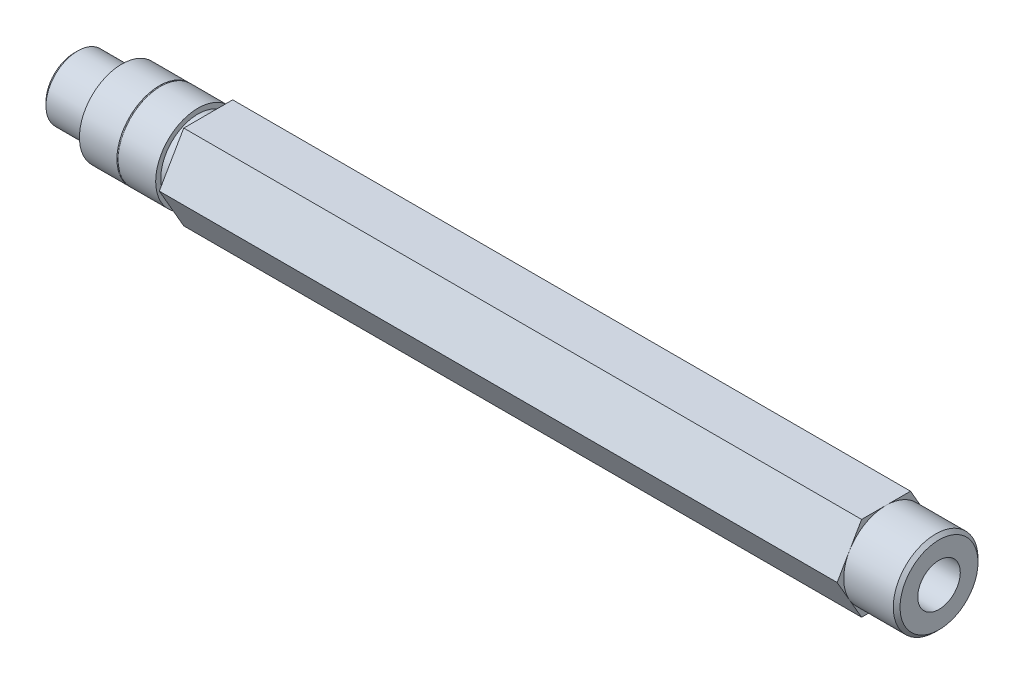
ISO-10303-21;
HEADER;
FILE_DESCRIPTION(('STEP AP214'),'2;1');
FILE_NAME('part.step','',(''),(''),'','','');
FILE_SCHEMA(('AUTOMOTIVE_DESIGN { 1 0 10303 214 1 1 1 1 }'));
ENDSEC;
DATA;
#1=APPLICATION_CONTEXT('core data for automotive mechanical design processes');
#2=APPLICATION_PROTOCOL_DEFINITION('international standard','automotive_design',2000,#1);
#3=PRODUCT_CONTEXT('',#1,'mechanical');
#4=PRODUCT('Part','Part','',(#3));
#5=PRODUCT_RELATED_PRODUCT_CATEGORY('part','',(#4));
#6=PRODUCT_DEFINITION_FORMATION('','',#4);
#7=PRODUCT_DEFINITION_CONTEXT('part definition',#1,'design');
#8=PRODUCT_DEFINITION('design','',#6,#7);
#9=PRODUCT_DEFINITION_SHAPE('','',#8);
#10=(LENGTH_UNIT() NAMED_UNIT(*) SI_UNIT(.MILLI.,.METRE.));
#11=(NAMED_UNIT(*) PLANE_ANGLE_UNIT() SI_UNIT($,.RADIAN.));
#12=(NAMED_UNIT(*) SI_UNIT($,.STERADIAN.) SOLID_ANGLE_UNIT());
#13=UNCERTAINTY_MEASURE_WITH_UNIT(LENGTH_MEASURE(1.E-05),#10,'distance_accuracy_value','');
#14=(GEOMETRIC_REPRESENTATION_CONTEXT(3) GLOBAL_UNCERTAINTY_ASSIGNED_CONTEXT((#13)) GLOBAL_UNIT_ASSIGNED_CONTEXT((#10,
#11,#12)) REPRESENTATION_CONTEXT('',''));
#15=CARTESIAN_POINT('',(0.,0.,0.));
#16=DIRECTION('',(0.,0.,1.));
#17=DIRECTION('',(1.,0.,0.));
#18=AXIS2_PLACEMENT_3D('',#15,#16,#17);
#19=CARTESIAN_POINT('',(12.827,0.,0.));
#20=DIRECTION('',(-1.,0.,0.));
#21=DIRECTION('',(0.,0.,1.));
#22=AXIS2_PLACEMENT_3D('',#19,#20,#21);
#23=TOROIDAL_SURFACE('',#22,6.35,0.0889);
#24=CARTESIAN_POINT('',(12.9159,0.,0.));
#25=DIRECTION('',(-1.,0.,0.));
#26=DIRECTION('',(0.,0.,1.));
#27=AXIS2_PLACEMENT_3D('',#24,#25,#26);
#28=CIRCLE('',#27,6.35);
#29=CARTESIAN_POINT('',(12.9159,0.,6.35));
#30=VERTEX_POINT('',#29);
#31=EDGE_CURVE('E21',#30,#30,#28,.T.);
#32=ORIENTED_EDGE('',*,*,#31,.T.);
#33=EDGE_LOOP('',(#32));
#34=FACE_BOUND('',#33,.T.);
#35=CARTESIAN_POINT('',(12.7381,0.,0.));
#36=DIRECTION('',(1.,0.,0.));
#37=DIRECTION('',(0.,0.,-1.));
#38=AXIS2_PLACEMENT_3D('',#35,#36,#37);
#39=CIRCLE('',#38,6.35);
#40=CARTESIAN_POINT('',(12.7381,0.,-6.35));
#41=VERTEX_POINT('',#40);
#42=EDGE_CURVE('E11',#41,#41,#39,.T.);
#43=ORIENTED_EDGE('',*,*,#42,.T.);
#44=EDGE_LOOP('',(#43));
#45=FACE_BOUND('',#44,.T.);
#46=ADVANCED_FACE('F17',(#34,#45),#23,.F.);
#47=CARTESIAN_POINT('',(18.542,0.,0.));
#48=DIRECTION('',(-1.,0.,0.));
#49=DIRECTION('',(0.,0.,1.));
#50=AXIS2_PLACEMENT_3D('',#47,#48,#49);
#51=CYLINDRICAL_SURFACE('',#50,6.35);
#52=ORIENTED_EDGE('',*,*,#42,.F.);
#53=EDGE_LOOP('',(#52));
#54=FACE_BOUND('',#53,.T.);
#55=CARTESIAN_POINT('',(7.112,0.,0.));
#56=DIRECTION('',(1.,0.,0.));
#57=DIRECTION('',(0.,0.,-1.));
#58=AXIS2_PLACEMENT_3D('',#55,#56,#57);
#59=CIRCLE('',#58,6.35);
#60=CARTESIAN_POINT('',(7.112,0.,-6.35));
#61=VERTEX_POINT('',#60);
#62=EDGE_CURVE('E181',#61,#61,#59,.T.);
#63=ORIENTED_EDGE('',*,*,#62,.T.);
#64=EDGE_LOOP('',(#63));
#65=FACE_BOUND('',#64,.T.);
#66=ADVANCED_FACE('F19',(#54,#65),#51,.T.);
#67=CARTESIAN_POINT('',(7.112,0.,0.));
#68=DIRECTION('',(-1.,0.,0.));
#69=DIRECTION('',(0.,0.,1.));
#70=AXIS2_PLACEMENT_3D('',#67,#68,#69);
#71=CYLINDRICAL_SURFACE('',#70,4.7625);
#72=CARTESIAN_POINT('',(7.112,0.,0.));
#73=DIRECTION('',(1.,0.,0.));
#74=DIRECTION('',(0.,0.,-1.));
#75=AXIS2_PLACEMENT_3D('',#72,#73,#74);
#76=CIRCLE('',#75,4.7625);
#77=CARTESIAN_POINT('',(7.112,0.,-4.7625));
#78=VERTEX_POINT('',#77);
#79=EDGE_CURVE('E177',#78,#78,#76,.T.);
#80=ORIENTED_EDGE('',*,*,#79,.F.);
#81=EDGE_LOOP('',(#80));
#82=FACE_BOUND('',#81,.T.);
#83=CARTESIAN_POINT('',(0.50800000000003,0.,0.));
#84=DIRECTION('',(1.,0.,0.));
#85=DIRECTION('',(0.,0.,-1.));
#86=AXIS2_PLACEMENT_3D('',#83,#84,#85);
#87=CIRCLE('',#86,4.7625);
#88=CARTESIAN_POINT('',(0.50800000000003,0.,-4.7625));
#89=VERTEX_POINT('',#88);
#90=EDGE_CURVE('E27',#89,#89,#87,.T.);
#91=ORIENTED_EDGE('',*,*,#90,.T.);
#92=EDGE_LOOP('',(#91));
#93=FACE_BOUND('',#92,.T.);
#94=ADVANCED_FACE('F352',(#82,#93),#71,.T.);
#95=CARTESIAN_POINT('',(0.50800000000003,0.,0.));
#96=DIRECTION('',(1.,0.,0.));
#97=DIRECTION('',(0.,0.,-1.));
#98=AXIS2_PLACEMENT_3D('',#95,#96,#97);
#99=CONICAL_SURFACE('',#98,4.7625,0.785398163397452);
#100=CARTESIAN_POINT('',(0.,0.,0.));
#101=DIRECTION('',(-1.,0.,0.));
#102=DIRECTION('',(0.,0.,-1.));
#103=AXIS2_PLACEMENT_3D('',#100,#101,#102);
#104=CIRCLE('',#103,4.2545);
#105=CARTESIAN_POINT('',(0.,0.,-4.2545));
#106=VERTEX_POINT('',#105);
#107=EDGE_CURVE('E187',#106,#106,#104,.T.);
#108=ORIENTED_EDGE('',*,*,#107,.F.);
#109=EDGE_LOOP('',(#108));
#110=FACE_BOUND('',#109,.T.);
#111=ORIENTED_EDGE('',*,*,#90,.F.);
#112=EDGE_LOOP('',(#111));
#113=FACE_BOUND('',#112,.T.);
#114=ADVANCED_FACE('F452',(#110,#113),#99,.T.);
#115=CARTESIAN_POINT('',(0.,0.,0.));
#116=DIRECTION('',(-1.,0.,0.));
#117=DIRECTION('',(0.,0.,1.));
#118=AXIS2_PLACEMENT_3D('',#115,#116,#117);
#119=CYLINDRICAL_SURFACE('',#118,3.1877);
#120=CARTESIAN_POINT('',(12.7,0.,0.));
#121=DIRECTION('',(-1.,0.,0.));
#122=DIRECTION('',(0.,0.,1.));
#123=AXIS2_PLACEMENT_3D('',#120,#121,#122);
#124=CIRCLE('',#123,3.1877);
#125=CARTESIAN_POINT('',(12.7,0.,3.1877));
#126=VERTEX_POINT('',#125);
#127=EDGE_CURVE('E191',#126,#126,#124,.T.);
#128=ORIENTED_EDGE('',*,*,#127,.F.);
#129=EDGE_LOOP('',(#128));
#130=FACE_BOUND('',#129,.T.);
#131=CARTESIAN_POINT('',(0.,0.,0.));
#132=DIRECTION('',(-1.,0.,0.));
#133=DIRECTION('',(0.,0.,1.));
#134=AXIS2_PLACEMENT_3D('',#131,#132,#133);
#135=CIRCLE('',#134,3.1877);
#136=CARTESIAN_POINT('',(0.,0.,3.1877));
#137=VERTEX_POINT('',#136);
#138=EDGE_CURVE('E199',#137,#137,#135,.T.);
#139=ORIENTED_EDGE('',*,*,#138,.T.);
#140=EDGE_LOOP('',(#139));
#141=FACE_BOUND('',#140,.T.);
#142=ADVANCED_FACE('F449',(#130,#141),#119,.F.);
#143=CARTESIAN_POINT('',(12.7,0.,0.));
#144=DIRECTION('',(-1.,0.,0.));
#145=DIRECTION('',(0.,0.,1.));
#146=AXIS2_PLACEMENT_3D('',#143,#144,#145);
#147=CONICAL_SURFACE('',#146,3.1877,1.02974425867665);
#148=CARTESIAN_POINT('',(14.6153633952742,0.,0.));
#149=VERTEX_POINT('',#148);
#150=VERTEX_LOOP('',#149);
#151=FACE_BOUND('',#150,.T.);
#152=ORIENTED_EDGE('',*,*,#127,.T.);
#153=EDGE_LOOP('',(#152));
#154=FACE_BOUND('',#153,.T.);
#155=ADVANCED_FACE('F447',(#151,#154),#147,.F.);
#156=CARTESIAN_POINT('',(0.,0.,0.));
#157=DIRECTION('',(-1.,0.,0.));
#158=DIRECTION('',(0.,0.,1.));
#159=AXIS2_PLACEMENT_3D('',#156,#157,#158);
#160=CYLINDRICAL_SURFACE('',#159,3.1877);
#161=CARTESIAN_POINT('',(116.9035,0.,0.));
#162=DIRECTION('',(1.,0.,0.));
#163=DIRECTION('',(0.,0.,-1.));
#164=AXIS2_PLACEMENT_3D('',#161,#162,#163);
#165=CIRCLE('',#164,3.1877);
#166=CARTESIAN_POINT('',(116.9035,0.,-3.1877));
#167=VERTEX_POINT('',#166);
#168=EDGE_CURVE('E229',#167,#167,#165,.T.);
#169=ORIENTED_EDGE('',*,*,#168,.F.);
#170=EDGE_LOOP('',(#169));
#171=FACE_BOUND('',#170,.T.);
#172=CARTESIAN_POINT('',(129.6035,0.,0.));
#173=DIRECTION('',(1.,0.,0.));
#174=DIRECTION('',(0.,0.,-1.));
#175=AXIS2_PLACEMENT_3D('',#172,#173,#174);
#176=CIRCLE('',#175,3.1877);
#177=CARTESIAN_POINT('',(129.6035,0.,-3.1877));
#178=VERTEX_POINT('',#177);
#179=EDGE_CURVE('E223',#178,#178,#176,.T.);
#180=ORIENTED_EDGE('',*,*,#179,.T.);
#181=EDGE_LOOP('',(#180));
#182=FACE_BOUND('',#181,.T.);
#183=ADVANCED_FACE('F471',(#171,#182),#160,.F.);
#184=CARTESIAN_POINT('',(116.9035,0.,0.));
#185=DIRECTION('',(1.,0.,0.));
#186=DIRECTION('',(0.,0.,-1.));
#187=AXIS2_PLACEMENT_3D('',#184,#185,#186);
#188=CONICAL_SURFACE('',#187,3.1877,1.02974425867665);
#189=CARTESIAN_POINT('',(114.988136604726,0.,0.));
#190=VERTEX_POINT('',#189);
#191=VERTEX_LOOP('',#190);
#192=FACE_BOUND('',#191,.T.);
#193=ORIENTED_EDGE('',*,*,#168,.T.);
#194=EDGE_LOOP('',(#193));
#195=FACE_BOUND('',#194,.T.);
#196=ADVANCED_FACE('F475',(#192,#195),#188,.F.);
#197=CARTESIAN_POINT('',(129.6035,0.,0.));
#198=DIRECTION('',(-1.,0.,0.));
#199=DIRECTION('',(0.,0.,1.));
#200=AXIS2_PLACEMENT_3D('',#197,#198,#199);
#201=CONICAL_SURFACE('',#200,5.842,0.785398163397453);
#202=CARTESIAN_POINT('',(129.6035,0.,0.));
#203=DIRECTION('',(1.,0.,0.));
#204=DIRECTION('',(0.,0.,-1.));
#205=AXIS2_PLACEMENT_3D('',#202,#203,#204);
#206=CIRCLE('',#205,5.842);
#207=CARTESIAN_POINT('',(129.6035,0.,-5.842));
#208=VERTEX_POINT('',#207);
#209=EDGE_CURVE('E209',#208,#208,#206,.T.);
#210=ORIENTED_EDGE('',*,*,#209,.F.);
#211=EDGE_LOOP('',(#210));
#212=FACE_BOUND('',#211,.T.);
#213=CARTESIAN_POINT('',(129.0955,0.,0.));
#214=DIRECTION('',(-1.,0.,0.));
#215=DIRECTION('',(0.,0.,-1.));
#216=AXIS2_PLACEMENT_3D('',#213,#214,#215);
#217=CIRCLE('',#216,6.35);
#218=CARTESIAN_POINT('',(129.0955,0.,-6.35));
#219=VERTEX_POINT('',#218);
#220=EDGE_CURVE('E232',#219,#219,#217,.T.);
#221=ORIENTED_EDGE('',*,*,#220,.F.);
#222=EDGE_LOOP('',(#221));
#223=FACE_BOUND('',#222,.T.);
#224=ADVANCED_FACE('F479',(#212,#223),#201,.T.);
#225=CARTESIAN_POINT('',(18.542,0.,0.));
#226=DIRECTION('',(-1.,0.,0.));
#227=DIRECTION('',(0.,0.,1.));
#228=AXIS2_PLACEMENT_3D('',#225,#226,#227);
#229=CYLINDRICAL_SURFACE('',#228,6.35);
#230=ORIENTED_EDGE('',*,*,#220,.T.);
#231=EDGE_LOOP('',(#230));
#232=FACE_BOUND('',#231,.T.);
#233=CARTESIAN_POINT('',(121.666,0.,0.));
#234=DIRECTION('',(1.,0.,0.));
#235=DIRECTION('',(0.,0.,-1.));
#236=AXIS2_PLACEMENT_3D('',#233,#234,#235);
#237=CIRCLE('',#236,6.35);
#238=CARTESIAN_POINT('',(121.666,3.175,5.49926131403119));
#239=VERTEX_POINT('',#238);
#240=CARTESIAN_POINT('',(121.666,-3.175,5.49926131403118));
#241=VERTEX_POINT('',#240);
#242=EDGE_CURVE('E280',#239,#241,#237,.T.);
#243=ORIENTED_EDGE('',*,*,#242,.T.);
#244=CARTESIAN_POINT('',(121.666,0.,0.));
#245=DIRECTION('',(1.,0.,0.));
#246=DIRECTION('',(0.,0.,-1.));
#247=AXIS2_PLACEMENT_3D('',#244,#245,#246);
#248=CIRCLE('',#247,6.35);
#249=CARTESIAN_POINT('',(121.666,-6.35,0.));
#250=VERTEX_POINT('',#249);
#251=EDGE_CURVE('E284',#241,#250,#248,.T.);
#252=ORIENTED_EDGE('',*,*,#251,.T.);
#253=CARTESIAN_POINT('',(121.666,0.,0.));
#254=DIRECTION('',(1.,0.,0.));
#255=DIRECTION('',(0.,0.,-1.));
#256=AXIS2_PLACEMENT_3D('',#253,#254,#255);
#257=CIRCLE('',#256,6.35);
#258=CARTESIAN_POINT('',(121.666,-3.175,-5.49926131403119));
#259=VERTEX_POINT('',#258);
#260=EDGE_CURVE('E311',#250,#259,#257,.T.);
#261=ORIENTED_EDGE('',*,*,#260,.T.);
#262=CARTESIAN_POINT('',(121.666,0.,0.));
#263=DIRECTION('',(1.,0.,0.));
#264=DIRECTION('',(0.,0.,-1.));
#265=AXIS2_PLACEMENT_3D('',#262,#263,#264);
#266=CIRCLE('',#265,6.35);
#267=CARTESIAN_POINT('',(121.666,3.175,-5.49926131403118));
#268=VERTEX_POINT('',#267);
#269=EDGE_CURVE('E206',#259,#268,#266,.T.);
#270=ORIENTED_EDGE('',*,*,#269,.T.);
#271=CARTESIAN_POINT('',(121.666,0.,0.));
#272=DIRECTION('',(1.,0.,0.));
#273=DIRECTION('',(0.,0.,-1.));
#274=AXIS2_PLACEMENT_3D('',#271,#272,#273);
#275=CIRCLE('',#274,6.35);
#276=CARTESIAN_POINT('',(121.666,6.35,0.));
#277=VERTEX_POINT('',#276);
#278=EDGE_CURVE('E303',#268,#277,#275,.T.);
#279=ORIENTED_EDGE('',*,*,#278,.T.);
#280=CARTESIAN_POINT('',(121.666,0.,0.));
#281=DIRECTION('',(1.,0.,0.));
#282=DIRECTION('',(0.,0.,-1.));
#283=AXIS2_PLACEMENT_3D('',#280,#281,#282);
#284=CIRCLE('',#283,6.35);
#285=EDGE_CURVE('E283',#277,#239,#284,.T.);
#286=ORIENTED_EDGE('',*,*,#285,.T.);
#287=EDGE_LOOP('',(#243,#252,#261,#270,#279,#286));
#288=FACE_BOUND('',#287,.T.);
#289=ADVANCED_FACE('F342',(#232,#288),#229,.T.);
#290=CARTESIAN_POINT('',(20.066,0.,0.));
#291=DIRECTION('',(-1.,0.,0.));
#292=DIRECTION('',(0.,0.,1.));
#293=AXIS2_PLACEMENT_3D('',#290,#291,#292);
#294=CYLINDRICAL_SURFACE('',#293,5.588);
#295=CARTESIAN_POINT('',(20.066,0.,0.));
#296=DIRECTION('',(1.,0.,0.));
#297=DIRECTION('',(0.,0.,-1.));
#298=AXIS2_PLACEMENT_3D('',#295,#296,#297);
#299=CIRCLE('',#298,5.588);
#300=CARTESIAN_POINT('',(20.066,0.,-5.588));
#301=VERTEX_POINT('',#300);
#302=EDGE_CURVE('E299',#301,#301,#299,.T.);
#303=ORIENTED_EDGE('',*,*,#302,.F.);
#304=EDGE_LOOP('',(#303));
#305=FACE_BOUND('',#304,.T.);
#306=CARTESIAN_POINT('',(18.542,0.,0.));
#307=DIRECTION('',(1.,0.,0.));
#308=DIRECTION('',(0.,0.,-1.));
#309=AXIS2_PLACEMENT_3D('',#306,#307,#308);
#310=CIRCLE('',#309,5.588);
#311=CARTESIAN_POINT('',(18.542,0.,-5.588));
#312=VERTEX_POINT('',#311);
#313=EDGE_CURVE('E302',#312,#312,#310,.T.);
#314=ORIENTED_EDGE('',*,*,#313,.T.);
#315=EDGE_LOOP('',(#314));
#316=FACE_BOUND('',#315,.T.);
#317=ADVANCED_FACE('F330',(#305,#316),#294,.T.);
#318=CARTESIAN_POINT('',(18.542,0.,0.));
#319=DIRECTION('',(-1.,0.,0.));
#320=DIRECTION('',(0.,0.,1.));
#321=AXIS2_PLACEMENT_3D('',#318,#319,#320);
#322=CYLINDRICAL_SURFACE('',#321,6.35);
#323=CARTESIAN_POINT('',(18.542,0.,0.));
#324=DIRECTION('',(1.,0.,0.));
#325=DIRECTION('',(0.,0.,-1.));
#326=AXIS2_PLACEMENT_3D('',#323,#324,#325);
#327=CIRCLE('',#326,6.35);
#328=CARTESIAN_POINT('',(18.542,0.,-6.35));
#329=VERTEX_POINT('',#328);
#330=EDGE_CURVE('E308',#329,#329,#327,.T.);
#331=ORIENTED_EDGE('',*,*,#330,.F.);
#332=EDGE_LOOP('',(#331));
#333=FACE_BOUND('',#332,.T.);
#334=ORIENTED_EDGE('',*,*,#31,.F.);
#335=EDGE_LOOP('',(#334));
#336=FACE_BOUND('',#335,.T.);
#337=ADVANCED_FACE('F327',(#333,#336),#322,.T.);
#338=CARTESIAN_POINT('',(121.666,0.,0.));
#339=DIRECTION('',(1.,0.,0.));
#340=DIRECTION('',(0.,1.,0.));
#341=AXIS2_PLACEMENT_3D('',#338,#339,#340);
#342=PLANE('',#341);
#343=ORIENTED_EDGE('',*,*,#278,.F.);
#344=DIRECTION('',(0.,0.866025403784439,0.5));
#345=VECTOR('',#344,1.);
#346=CARTESIAN_POINT('',(121.666,0.,-7.33234841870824));
#347=LINE('',#346,#345);
#348=CARTESIAN_POINT('',(121.666,6.35,-3.66617420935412));
#349=VERTEX_POINT('',#348);
#350=EDGE_CURVE('E275',#268,#349,#347,.T.);
#351=ORIENTED_EDGE('',*,*,#350,.T.);
#352=DIRECTION('',(0.,0.,1.));
#353=VECTOR('',#352,1.);
#354=CARTESIAN_POINT('',(121.666,6.35,-3.66617420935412));
#355=LINE('',#354,#353);
#356=EDGE_CURVE('E193',#349,#277,#355,.T.);
#357=ORIENTED_EDGE('',*,*,#356,.T.);
#358=EDGE_LOOP('',(#343,#351,#357));
#359=FACE_BOUND('',#358,.T.);
#360=ADVANCED_FACE('F329',(#359),#342,.T.);
#361=CARTESIAN_POINT('',(121.666,0.,0.));
#362=DIRECTION('',(1.,0.,0.));
#363=DIRECTION('',(0.,1.,0.));
#364=AXIS2_PLACEMENT_3D('',#361,#362,#363);
#365=PLANE('',#364);
#366=ORIENTED_EDGE('',*,*,#285,.F.);
#367=DIRECTION('',(0.,0.,1.));
#368=VECTOR('',#367,1.);
#369=CARTESIAN_POINT('',(121.666,6.35,-3.66617420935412));
#370=LINE('',#369,#368);
#371=CARTESIAN_POINT('',(121.666,6.35,3.66617420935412));
#372=VERTEX_POINT('',#371);
#373=EDGE_CURVE('E197',#277,#372,#370,.T.);
#374=ORIENTED_EDGE('',*,*,#373,.T.);
#375=DIRECTION('',(0.,-0.866025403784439,0.5));
#376=VECTOR('',#375,1.);
#377=CARTESIAN_POINT('',(121.666,6.35,3.66617420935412));
#378=LINE('',#377,#376);
#379=EDGE_CURVE('E256',#372,#239,#378,.T.);
#380=ORIENTED_EDGE('',*,*,#379,.T.);
#381=EDGE_LOOP('',(#366,#374,#380));
#382=FACE_BOUND('',#381,.T.);
#383=ADVANCED_FACE('F339',(#382),#365,.T.);
#384=CARTESIAN_POINT('',(121.666,0.,0.));
#385=DIRECTION('',(1.,0.,0.));
#386=DIRECTION('',(0.,1.,0.));
#387=AXIS2_PLACEMENT_3D('',#384,#385,#386);
#388=PLANE('',#387);
#389=ORIENTED_EDGE('',*,*,#242,.F.);
#390=DIRECTION('',(0.,-0.866025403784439,0.5));
#391=VECTOR('',#390,1.);
#392=CARTESIAN_POINT('',(121.666,6.35,3.66617420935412));
#393=LINE('',#392,#391);
#394=CARTESIAN_POINT('',(121.666,0.,7.33234841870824));
#395=VERTEX_POINT('',#394);
#396=EDGE_CURVE('E261',#239,#395,#393,.T.);
#397=ORIENTED_EDGE('',*,*,#396,.T.);
#398=DIRECTION('',(0.,-0.866025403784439,-0.5));
#399=VECTOR('',#398,1.);
#400=CARTESIAN_POINT('',(121.666,0.,7.33234841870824));
#401=LINE('',#400,#399);
#402=EDGE_CURVE('E213',#395,#241,#401,.T.);
#403=ORIENTED_EDGE('',*,*,#402,.T.);
#404=EDGE_LOOP('',(#389,#397,#403));
#405=FACE_BOUND('',#404,.T.);
#406=ADVANCED_FACE('F395',(#405),#388,.T.);
#407=CARTESIAN_POINT('',(121.666,0.,0.));
#408=DIRECTION('',(1.,0.,0.));
#409=DIRECTION('',(0.,1.,0.));
#410=AXIS2_PLACEMENT_3D('',#407,#408,#409);
#411=PLANE('',#410);
#412=ORIENTED_EDGE('',*,*,#251,.F.);
#413=DIRECTION('',(0.,-0.866025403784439,-0.5));
#414=VECTOR('',#413,1.);
#415=CARTESIAN_POINT('',(121.666,0.,7.33234841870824));
#416=LINE('',#415,#414);
#417=CARTESIAN_POINT('',(121.666,-6.35,3.66617420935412));
#418=VERTEX_POINT('',#417);
#419=EDGE_CURVE('E210',#241,#418,#416,.T.);
#420=ORIENTED_EDGE('',*,*,#419,.T.);
#421=DIRECTION('',(0.,0.,-1.));
#422=VECTOR('',#421,1.);
#423=CARTESIAN_POINT('',(121.666,-6.35,3.66617420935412));
#424=LINE('',#423,#422);
#425=EDGE_CURVE('E239',#418,#250,#424,.T.);
#426=ORIENTED_EDGE('',*,*,#425,.T.);
#427=EDGE_LOOP('',(#412,#420,#426));
#428=FACE_BOUND('',#427,.T.);
#429=ADVANCED_FACE('F377',(#428),#411,.T.);
#430=CARTESIAN_POINT('',(121.666,0.,0.));
#431=DIRECTION('',(1.,0.,0.));
#432=DIRECTION('',(0.,1.,0.));
#433=AXIS2_PLACEMENT_3D('',#430,#431,#432);
#434=PLANE('',#433);
#435=ORIENTED_EDGE('',*,*,#260,.F.);
#436=DIRECTION('',(0.,0.,-1.));
#437=VECTOR('',#436,1.);
#438=CARTESIAN_POINT('',(121.666,-6.35,3.66617420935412));
#439=LINE('',#438,#437);
#440=CARTESIAN_POINT('',(121.666,-6.35,-3.66617420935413));
#441=VERTEX_POINT('',#440);
#442=EDGE_CURVE('E219',#250,#441,#439,.T.);
#443=ORIENTED_EDGE('',*,*,#442,.T.);
#444=DIRECTION('',(0.,0.866025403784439,-0.5));
#445=VECTOR('',#444,1.);
#446=CARTESIAN_POINT('',(121.666,-6.35,-3.66617420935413));
#447=LINE('',#446,#445);
#448=EDGE_CURVE('E295',#441,#259,#447,.T.);
#449=ORIENTED_EDGE('',*,*,#448,.T.);
#450=EDGE_LOOP('',(#435,#443,#449));
#451=FACE_BOUND('',#450,.T.);
#452=ADVANCED_FACE('F373',(#451),#434,.T.);
#453=CARTESIAN_POINT('',(18.542,0.,0.));
#454=DIRECTION('',(1.,0.,0.));
#455=DIRECTION('',(0.,1.,0.));
#456=AXIS2_PLACEMENT_3D('',#453,#454,#455);
#457=PLANE('',#456);
#458=ORIENTED_EDGE('',*,*,#330,.T.);
#459=EDGE_LOOP('',(#458));
#460=FACE_BOUND('',#459,.T.);
#461=ORIENTED_EDGE('',*,*,#313,.F.);
#462=EDGE_LOOP('',(#461));
#463=FACE_BOUND('',#462,.T.);
#464=ADVANCED_FACE('F376',(#460,#463),#457,.T.);
#465=CARTESIAN_POINT('',(20.066,0.,0.));
#466=DIRECTION('',(1.,0.,0.));
#467=DIRECTION('',(0.,1.,0.));
#468=AXIS2_PLACEMENT_3D('',#465,#466,#467);
#469=PLANE('',#468);
#470=DIRECTION('',(0.,0.866025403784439,-0.5));
#471=VECTOR('',#470,1.);
#472=CARTESIAN_POINT('',(20.066,-6.35,-3.66617420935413));
#473=LINE('',#472,#471);
#474=CARTESIAN_POINT('',(20.066,-6.35,-3.66617420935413));
#475=VERTEX_POINT('',#474);
#476=CARTESIAN_POINT('',(20.066,0.,-7.33234841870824));
#477=VERTEX_POINT('',#476);
#478=EDGE_CURVE('E274',#475,#477,#473,.T.);
#479=ORIENTED_EDGE('',*,*,#478,.F.);
#480=DIRECTION('',(0.,0.,-1.));
#481=VECTOR('',#480,1.);
#482=CARTESIAN_POINT('',(20.066,-6.35,3.66617420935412));
#483=LINE('',#482,#481);
#484=CARTESIAN_POINT('',(20.066,-6.35,3.66617420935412));
#485=VERTEX_POINT('',#484);
#486=EDGE_CURVE('E220',#485,#475,#483,.T.);
#487=ORIENTED_EDGE('',*,*,#486,.F.);
#488=DIRECTION('',(0.,-0.866025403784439,-0.5));
#489=VECTOR('',#488,1.);
#490=CARTESIAN_POINT('',(20.066,0.,7.33234841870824));
#491=LINE('',#490,#489);
#492=CARTESIAN_POINT('',(20.066,0.,7.33234841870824));
#493=VERTEX_POINT('',#492);
#494=EDGE_CURVE('E214',#493,#485,#491,.T.);
#495=ORIENTED_EDGE('',*,*,#494,.F.);
#496=DIRECTION('',(0.,-0.866025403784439,0.5));
#497=VECTOR('',#496,1.);
#498=CARTESIAN_POINT('',(20.066,6.35,3.66617420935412));
#499=LINE('',#498,#497);
#500=CARTESIAN_POINT('',(20.066,6.35,3.66617420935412));
#501=VERTEX_POINT('',#500);
#502=EDGE_CURVE('E255',#501,#493,#499,.T.);
#503=ORIENTED_EDGE('',*,*,#502,.F.);
#504=DIRECTION('',(0.,0.,1.));
#505=VECTOR('',#504,1.);
#506=CARTESIAN_POINT('',(20.066,6.35,-3.66617420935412));
#507=LINE('',#506,#505);
#508=CARTESIAN_POINT('',(20.066,6.35,-3.66617420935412));
#509=VERTEX_POINT('',#508);
#510=EDGE_CURVE('E269',#509,#501,#507,.T.);
#511=ORIENTED_EDGE('',*,*,#510,.F.);
#512=DIRECTION('',(0.,0.866025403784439,0.5));
#513=VECTOR('',#512,1.);
#514=CARTESIAN_POINT('',(20.066,0.,-7.33234841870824));
#515=LINE('',#514,#513);
#516=EDGE_CURVE('E288',#477,#509,#515,.T.);
#517=ORIENTED_EDGE('',*,*,#516,.F.);
#518=EDGE_LOOP('',(#479,#487,#495,#503,#511,#517));
#519=FACE_BOUND('',#518,.T.);
#520=ORIENTED_EDGE('',*,*,#302,.T.);
#521=EDGE_LOOP('',(#520));
#522=FACE_BOUND('',#521,.T.);
#523=ADVANCED_FACE('F385',(#519,#522),#469,.F.);
#524=CARTESIAN_POINT('',(121.666,-6.35,-3.66617420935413));
#525=DIRECTION('',(0.,0.5,0.866025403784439));
#526=DIRECTION('',(1.,0.,0.));
#527=AXIS2_PLACEMENT_3D('',#524,#525,#526);
#528=PLANE('',#527);
#529=ORIENTED_EDGE('',*,*,#478,.T.);
#530=DIRECTION('',(-1.,0.,0.));
#531=VECTOR('',#530,1.);
#532=CARTESIAN_POINT('',(121.666,0.,-7.33234841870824));
#533=LINE('',#532,#531);
#534=CARTESIAN_POINT('',(121.666,0.,-7.33234841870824));
#535=VERTEX_POINT('',#534);
#536=EDGE_CURVE('E270',#535,#477,#533,.T.);
#537=ORIENTED_EDGE('',*,*,#536,.F.);
#538=DIRECTION('',(0.,0.866025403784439,-0.5));
#539=VECTOR('',#538,1.);
#540=CARTESIAN_POINT('',(121.666,-6.35,-3.66617420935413));
#541=LINE('',#540,#539);
#542=EDGE_CURVE('E201',#259,#535,#541,.T.);
#543=ORIENTED_EDGE('',*,*,#542,.F.);
#544=ORIENTED_EDGE('',*,*,#448,.F.);
#545=DIRECTION('',(-1.,0.,0.));
#546=VECTOR('',#545,1.);
#547=CARTESIAN_POINT('',(121.666,-6.35,-3.66617420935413));
#548=LINE('',#547,#546);
#549=EDGE_CURVE('E215',#441,#475,#548,.T.);
#550=ORIENTED_EDGE('',*,*,#549,.T.);
#551=EDGE_LOOP('',(#529,#537,#543,#544,#550));
#552=FACE_BOUND('',#551,.T.);
#553=ADVANCED_FACE('F367',(#552),#528,.F.);
#554=CARTESIAN_POINT('',(121.666,0.,-7.33234841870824));
#555=DIRECTION('',(0.,-0.5,0.866025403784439));
#556=DIRECTION('',(-1.,0.,0.));
#557=AXIS2_PLACEMENT_3D('',#554,#555,#556);
#558=PLANE('',#557);
#559=ORIENTED_EDGE('',*,*,#516,.T.);
#560=DIRECTION('',(-1.,0.,0.));
#561=VECTOR('',#560,1.);
#562=CARTESIAN_POINT('',(121.666,6.35,-3.66617420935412));
#563=LINE('',#562,#561);
#564=EDGE_CURVE('E196',#349,#509,#563,.T.);
#565=ORIENTED_EDGE('',*,*,#564,.F.);
#566=ORIENTED_EDGE('',*,*,#350,.F.);
#567=DIRECTION('',(0.,0.866025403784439,0.5));
#568=VECTOR('',#567,1.);
#569=CARTESIAN_POINT('',(121.666,0.,-7.33234841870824));
#570=LINE('',#569,#568);
#571=EDGE_CURVE('E205',#535,#268,#570,.T.);
#572=ORIENTED_EDGE('',*,*,#571,.F.);
#573=ORIENTED_EDGE('',*,*,#536,.T.);
#574=EDGE_LOOP('',(#559,#565,#566,#572,#573));
#575=FACE_BOUND('',#574,.T.);
#576=ADVANCED_FACE('F363',(#575),#558,.F.);
#577=CARTESIAN_POINT('',(121.666,6.35,-3.66617420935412));
#578=DIRECTION('',(0.,-1.,0.));
#579=DIRECTION('',(0.,0.,-1.));
#580=AXIS2_PLACEMENT_3D('',#577,#578,#579);
#581=PLANE('',#580);
#582=ORIENTED_EDGE('',*,*,#510,.T.);
#583=DIRECTION('',(-1.,0.,0.));
#584=VECTOR('',#583,1.);
#585=CARTESIAN_POINT('',(121.666,6.35,3.66617420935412));
#586=LINE('',#585,#584);
#587=EDGE_CURVE('E260',#372,#501,#586,.T.);
#588=ORIENTED_EDGE('',*,*,#587,.F.);
#589=ORIENTED_EDGE('',*,*,#373,.F.);
#590=ORIENTED_EDGE('',*,*,#356,.F.);
#591=ORIENTED_EDGE('',*,*,#564,.T.);
#592=EDGE_LOOP('',(#582,#588,#589,#590,#591));
#593=FACE_BOUND('',#592,.T.);
#594=ADVANCED_FACE('F366',(#593),#581,.F.);
#595=CARTESIAN_POINT('',(121.666,6.35,3.66617420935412));
#596=DIRECTION('',(0.,-0.5,-0.866025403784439));
#597=DIRECTION('',(0.,-0.866025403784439,0.5));
#598=AXIS2_PLACEMENT_3D('',#595,#596,#597);
#599=PLANE('',#598);
#600=ORIENTED_EDGE('',*,*,#502,.T.);
#601=DIRECTION('',(-1.,0.,0.));
#602=VECTOR('',#601,1.);
#603=CARTESIAN_POINT('',(121.666,0.,7.33234841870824));
#604=LINE('',#603,#602);
#605=EDGE_CURVE('E249',#395,#493,#604,.T.);
#606=ORIENTED_EDGE('',*,*,#605,.F.);
#607=ORIENTED_EDGE('',*,*,#396,.F.);
#608=ORIENTED_EDGE('',*,*,#379,.F.);
#609=ORIENTED_EDGE('',*,*,#587,.T.);
#610=EDGE_LOOP('',(#600,#606,#607,#608,#609));
#611=FACE_BOUND('',#610,.T.);
#612=ADVANCED_FACE('F381',(#611),#599,.F.);
#613=CARTESIAN_POINT('',(121.666,0.,7.33234841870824));
#614=DIRECTION('',(0.,0.5,-0.866025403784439));
#615=DIRECTION('',(-1.,0.,0.));
#616=AXIS2_PLACEMENT_3D('',#613,#614,#615);
#617=PLANE('',#616);
#618=ORIENTED_EDGE('',*,*,#494,.T.);
#619=DIRECTION('',(-1.,0.,0.));
#620=VECTOR('',#619,1.);
#621=CARTESIAN_POINT('',(121.666,-6.35,3.66617420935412));
#622=LINE('',#621,#620);
#623=EDGE_CURVE('E243',#418,#485,#622,.T.);
#624=ORIENTED_EDGE('',*,*,#623,.F.);
#625=ORIENTED_EDGE('',*,*,#419,.F.);
#626=ORIENTED_EDGE('',*,*,#402,.F.);
#627=ORIENTED_EDGE('',*,*,#605,.T.);
#628=EDGE_LOOP('',(#618,#624,#625,#626,#627));
#629=FACE_BOUND('',#628,.T.);
#630=ADVANCED_FACE('F371',(#629),#617,.F.);
#631=CARTESIAN_POINT('',(121.666,-6.35,3.66617420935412));
#632=DIRECTION('',(0.,1.,0.));
#633=DIRECTION('',(1.,0.,0.));
#634=AXIS2_PLACEMENT_3D('',#631,#632,#633);
#635=PLANE('',#634);
#636=ORIENTED_EDGE('',*,*,#486,.T.);
#637=ORIENTED_EDGE('',*,*,#549,.F.);
#638=ORIENTED_EDGE('',*,*,#442,.F.);
#639=ORIENTED_EDGE('',*,*,#425,.F.);
#640=ORIENTED_EDGE('',*,*,#623,.T.);
#641=EDGE_LOOP('',(#636,#637,#638,#639,#640));
#642=FACE_BOUND('',#641,.T.);
#643=ADVANCED_FACE('F361',(#642),#635,.F.);
#644=CARTESIAN_POINT('',(121.666,0.,0.));
#645=DIRECTION('',(1.,0.,0.));
#646=DIRECTION('',(0.,1.,0.));
#647=AXIS2_PLACEMENT_3D('',#644,#645,#646);
#648=PLANE('',#647);
#649=ORIENTED_EDGE('',*,*,#269,.F.);
#650=ORIENTED_EDGE('',*,*,#542,.T.);
#651=ORIENTED_EDGE('',*,*,#571,.T.);
#652=EDGE_LOOP('',(#649,#650,#651));
#653=FACE_BOUND('',#652,.T.);
#654=ADVANCED_FACE('F358',(#653),#648,.T.);
#655=CARTESIAN_POINT('',(129.6035,0.,0.));
#656=DIRECTION('',(1.,0.,0.));
#657=DIRECTION('',(0.,1.,0.));
#658=AXIS2_PLACEMENT_3D('',#655,#656,#657);
#659=PLANE('',#658);
#660=ORIENTED_EDGE('',*,*,#179,.F.);
#661=EDGE_LOOP('',(#660));
#662=FACE_BOUND('',#661,.T.);
#663=ORIENTED_EDGE('',*,*,#209,.T.);
#664=EDGE_LOOP('',(#663));
#665=FACE_BOUND('',#664,.T.);
#666=ADVANCED_FACE('F356',(#662,#665),#659,.T.);
#667=CARTESIAN_POINT('',(0.,0.,0.));
#668=DIRECTION('',(1.,0.,0.));
#669=DIRECTION('',(0.,1.,0.));
#670=AXIS2_PLACEMENT_3D('',#667,#668,#669);
#671=PLANE('',#670);
#672=ORIENTED_EDGE('',*,*,#138,.F.);
#673=EDGE_LOOP('',(#672));
#674=FACE_BOUND('',#673,.T.);
#675=ORIENTED_EDGE('',*,*,#107,.T.);
#676=EDGE_LOOP('',(#675));
#677=FACE_BOUND('',#676,.T.);
#678=ADVANCED_FACE('F456',(#674,#677),#671,.F.);
#679=CARTESIAN_POINT('',(7.112,0.,0.));
#680=DIRECTION('',(1.,0.,0.));
#681=DIRECTION('',(0.,1.,0.));
#682=AXIS2_PLACEMENT_3D('',#679,#680,#681);
#683=PLANE('',#682);
#684=ORIENTED_EDGE('',*,*,#62,.F.);
#685=EDGE_LOOP('',(#684));
#686=FACE_BOUND('',#685,.T.);
#687=ORIENTED_EDGE('',*,*,#79,.T.);
#688=EDGE_LOOP('',(#687));
#689=FACE_BOUND('',#688,.T.);
#690=ADVANCED_FACE('F178',(#686,#689),#683,.F.);
#691=CLOSED_SHELL('',(#46,#66,#94,#114,#142,#155,#183,#196,#224,#289,#317,#337,#360,#383,#406,
#429,#452,#464,#523,#553,#576,#594,#612,#630,#643,#654,#666,#678,#690));
#692=MANIFOLD_SOLID_BREP('B1',#691);
#693=ADVANCED_BREP_SHAPE_REPRESENTATION('',(#18,#692),#14);
#694=SHAPE_DEFINITION_REPRESENTATION(#9,#693);
ENDSEC;
END-ISO-10303-21;
